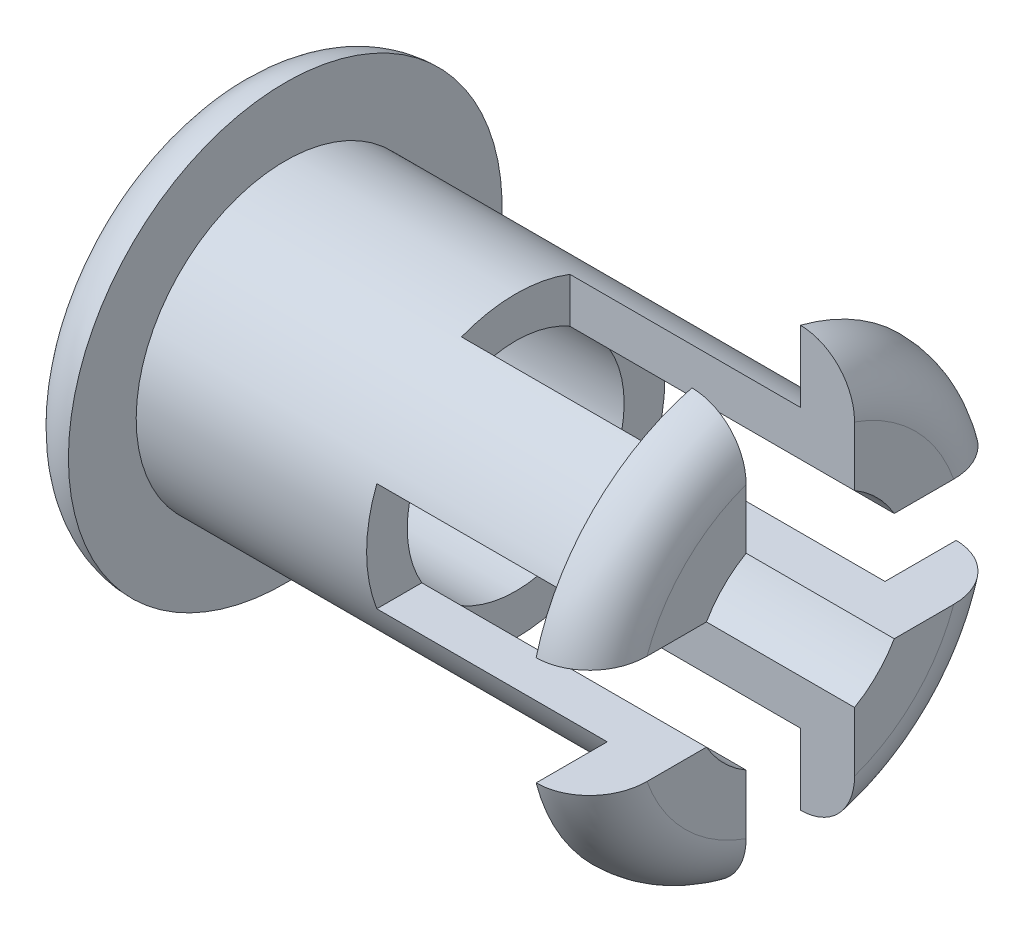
ISO-10303-21;
HEADER;
FILE_DESCRIPTION(('STEP AP214'),'2;1');
FILE_NAME('part.step','',(''),(''),'','','');
FILE_SCHEMA(('AUTOMOTIVE_DESIGN { 1 0 10303 214 1 1 1 1 }'));
ENDSEC;
DATA;
#1=APPLICATION_CONTEXT('core data for automotive mechanical design processes');
#2=APPLICATION_PROTOCOL_DEFINITION('international standard','automotive_design',2000,#1);
#3=PRODUCT_CONTEXT('',#1,'mechanical');
#4=PRODUCT('Part','Part','',(#3));
#5=PRODUCT_RELATED_PRODUCT_CATEGORY('part','',(#4));
#6=PRODUCT_DEFINITION_FORMATION('','',#4);
#7=PRODUCT_DEFINITION_CONTEXT('part definition',#1,'design');
#8=PRODUCT_DEFINITION('design','',#6,#7);
#9=PRODUCT_DEFINITION_SHAPE('','',#8);
#10=(LENGTH_UNIT() NAMED_UNIT(*) SI_UNIT(.MILLI.,.METRE.));
#11=(NAMED_UNIT(*) PLANE_ANGLE_UNIT() SI_UNIT($,.RADIAN.));
#12=(NAMED_UNIT(*) SI_UNIT($,.STERADIAN.) SOLID_ANGLE_UNIT());
#13=UNCERTAINTY_MEASURE_WITH_UNIT(LENGTH_MEASURE(1.E-05),#10,'distance_accuracy_value','');
#14=(GEOMETRIC_REPRESENTATION_CONTEXT(3) GLOBAL_UNCERTAINTY_ASSIGNED_CONTEXT((#13)) GLOBAL_UNIT_ASSIGNED_CONTEXT((#10,
#11,#12)) REPRESENTATION_CONTEXT('',''));
#15=CARTESIAN_POINT('',(0.,0.,0.));
#16=DIRECTION('',(0.,0.,1.));
#17=DIRECTION('',(1.,0.,0.));
#18=AXIS2_PLACEMENT_3D('',#15,#16,#17);
#19=CARTESIAN_POINT('',(16.66875,0.,0.));
#20=DIRECTION('',(1.,0.,0.));
#21=DIRECTION('',(0.,0.,-1.));
#22=AXIS2_PLACEMENT_3D('',#19,#20,#21);
#23=PLANE('',#22);
#24=DIRECTION('',(0.,0.,1.));
#25=VECTOR('',#24,1.);
#26=CARTESIAN_POINT('',(16.66875,3.175,-12.7));
#27=LINE('',#26,#25);
#28=CARTESIAN_POINT('',(16.66875,3.175,-8.98025612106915));
#29=VERTEX_POINT('',#28);
#30=CARTESIAN_POINT('',(16.66875,3.175,-5.49926131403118));
#31=VERTEX_POINT('',#30);
#32=EDGE_CURVE('E319',#29,#31,#27,.T.);
#33=ORIENTED_EDGE('',*,*,#32,.F.);
#34=CARTESIAN_POINT('',(16.66875,0.,0.));
#35=DIRECTION('',(1.,0.,0.));
#36=DIRECTION('',(0.,0.,-1.));
#37=AXIS2_PLACEMENT_3D('',#34,#35,#36);
#38=CIRCLE('',#37,9.525);
#39=CARTESIAN_POINT('',(16.66875,8.98025612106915,-3.175));
#40=VERTEX_POINT('',#39);
#41=EDGE_CURVE('E443',#29,#40,#38,.T.);
#42=ORIENTED_EDGE('',*,*,#41,.T.);
#43=DIRECTION('',(0.,1.,0.));
#44=VECTOR('',#43,1.);
#45=CARTESIAN_POINT('',(16.66875,-12.7,-3.175));
#46=LINE('',#45,#44);
#47=CARTESIAN_POINT('',(16.66875,5.49926131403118,-3.175));
#48=VERTEX_POINT('',#47);
#49=EDGE_CURVE('E207',#48,#40,#46,.T.);
#50=ORIENTED_EDGE('',*,*,#49,.F.);
#51=CARTESIAN_POINT('',(16.66875,0.,0.));
#52=DIRECTION('',(-1.,0.,0.));
#53=DIRECTION('',(0.,0.,1.));
#54=AXIS2_PLACEMENT_3D('',#51,#52,#53);
#55=CIRCLE('',#54,6.35);
#56=EDGE_CURVE('E230',#48,#31,#55,.T.);
#57=ORIENTED_EDGE('',*,*,#56,.T.);
#58=EDGE_LOOP('',(#33,#42,#50,#57));
#59=FACE_BOUND('',#58,.T.);
#60=ADVANCED_FACE('F32',(#59),#23,.T.);
#61=CARTESIAN_POINT('',(13.49375,0.,0.));
#62=DIRECTION('',(1.,0.,0.));
#63=DIRECTION('',(0.,0.,-1.));
#64=AXIS2_PLACEMENT_3D('',#61,#62,#63);
#65=PLANE('',#64);
#66=CARTESIAN_POINT('',(13.49375,0.,0.));
#67=DIRECTION('',(1.,0.,0.));
#68=DIRECTION('',(0.,0.,-1.));
#69=AXIS2_PLACEMENT_3D('',#66,#67,#68);
#70=CIRCLE('',#69,8.73125);
#71=CARTESIAN_POINT('',(13.49375,3.175,-8.13351717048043));
#72=VERTEX_POINT('',#71);
#73=CARTESIAN_POINT('',(13.49375,8.13351717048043,-3.175));
#74=VERTEX_POINT('',#73);
#75=EDGE_CURVE('E349',#72,#74,#70,.T.);
#76=ORIENTED_EDGE('',*,*,#75,.T.);
#77=DIRECTION('',(0.,1.,0.));
#78=VECTOR('',#77,1.);
#79=CARTESIAN_POINT('',(13.49375,0.,-3.175));
#80=LINE('',#79,#78);
#81=CARTESIAN_POINT('',(13.49375,12.2967221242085,-3.175));
#82=VERTEX_POINT('',#81);
#83=EDGE_CURVE('E450',#74,#82,#80,.T.);
#84=ORIENTED_EDGE('',*,*,#83,.T.);
#85=CARTESIAN_POINT('',(13.49375,0.,0.));
#86=DIRECTION('',(1.,0.,0.));
#87=DIRECTION('',(0.,0.,-1.));
#88=AXIS2_PLACEMENT_3D('',#85,#86,#87);
#89=CIRCLE('',#88,12.7);
#90=CARTESIAN_POINT('',(13.49375,3.175,-12.2967221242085));
#91=VERTEX_POINT('',#90);
#92=EDGE_CURVE('E247',#91,#82,#89,.T.);
#93=ORIENTED_EDGE('',*,*,#92,.F.);
#94=DIRECTION('',(0.,0.,1.));
#95=VECTOR('',#94,1.);
#96=CARTESIAN_POINT('',(13.49375,3.175,0.));
#97=LINE('',#96,#95);
#98=EDGE_CURVE('E278',#91,#72,#97,.T.);
#99=ORIENTED_EDGE('',*,*,#98,.T.);
#100=EDGE_LOOP('',(#76,#84,#93,#99));
#101=FACE_BOUND('',#100,.T.);
#102=ADVANCED_FACE('F453',(#101),#65,.F.);
#103=CARTESIAN_POINT('',(16.66875,-8.98025612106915,-3.175));
#104=VERTEX_POINT('',#103);
#105=CARTESIAN_POINT('',(16.66875,-5.49926131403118,-3.175));
#106=VERTEX_POINT('',#105);
#107=EDGE_CURVE('E464',#104,#106,#46,.T.);
#108=ORIENTED_EDGE('',*,*,#107,.F.);
#109=CARTESIAN_POINT('',(16.66875,0.,0.));
#110=DIRECTION('',(1.,0.,0.));
#111=DIRECTION('',(0.,0.,-1.));
#112=AXIS2_PLACEMENT_3D('',#109,#110,#111);
#113=CIRCLE('',#112,9.525);
#114=CARTESIAN_POINT('',(16.66875,-3.175,-8.98025612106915));
#115=VERTEX_POINT('',#114);
#116=EDGE_CURVE('E418',#104,#115,#113,.T.);
#117=ORIENTED_EDGE('',*,*,#116,.T.);
#118=DIRECTION('',(0.,0.,1.));
#119=VECTOR('',#118,1.);
#120=CARTESIAN_POINT('',(16.66875,-3.175,-12.7));
#121=LINE('',#120,#119);
#122=CARTESIAN_POINT('',(16.66875,-3.175,-5.49926131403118));
#123=VERTEX_POINT('',#122);
#124=EDGE_CURVE('E327',#115,#123,#121,.T.);
#125=ORIENTED_EDGE('',*,*,#124,.T.);
#126=EDGE_CURVE('E227',#123,#106,#55,.T.);
#127=ORIENTED_EDGE('',*,*,#126,.T.);
#128=EDGE_LOOP('',(#108,#117,#125,#127));
#129=FACE_BOUND('',#128,.T.);
#130=ADVANCED_FACE('F496',(#129),#23,.T.);
#131=CARTESIAN_POINT('',(13.49375,-12.2967221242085,-3.175));
#132=VERTEX_POINT('',#131);
#133=CARTESIAN_POINT('',(13.49375,-3.175,-12.2967221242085));
#134=VERTEX_POINT('',#133);
#135=EDGE_CURVE('E239',#132,#134,#89,.T.);
#136=ORIENTED_EDGE('',*,*,#135,.F.);
#137=DIRECTION('',(0.,1.,0.));
#138=VECTOR('',#137,1.);
#139=CARTESIAN_POINT('',(13.49375,0.,-3.175));
#140=LINE('',#139,#138);
#141=CARTESIAN_POINT('',(13.49375,-8.13351717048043,-3.175));
#142=VERTEX_POINT('',#141);
#143=EDGE_CURVE('E479',#132,#142,#140,.T.);
#144=ORIENTED_EDGE('',*,*,#143,.T.);
#145=CARTESIAN_POINT('',(13.49375,-3.175,-8.13351717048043));
#146=VERTEX_POINT('',#145);
#147=EDGE_CURVE('E347',#142,#146,#70,.T.);
#148=ORIENTED_EDGE('',*,*,#147,.T.);
#149=DIRECTION('',(0.,0.,-1.));
#150=VECTOR('',#149,1.);
#151=CARTESIAN_POINT('',(13.49375,-3.175,0.));
#152=LINE('',#151,#150);
#153=EDGE_CURVE('E313',#146,#134,#152,.T.);
#154=ORIENTED_EDGE('',*,*,#153,.T.);
#155=EDGE_LOOP('',(#136,#144,#148,#154));
#156=FACE_BOUND('',#155,.T.);
#157=ADVANCED_FACE('F504',(#156),#65,.F.);
#158=DIRECTION('',(0.,1.,0.));
#159=VECTOR('',#158,1.);
#160=CARTESIAN_POINT('',(16.66875,-12.7,3.175));
#161=LINE('',#160,#159);
#162=CARTESIAN_POINT('',(16.66875,5.49926131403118,3.175));
#163=VERTEX_POINT('',#162);
#164=CARTESIAN_POINT('',(16.66875,8.98025612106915,3.175));
#165=VERTEX_POINT('',#164);
#166=EDGE_CURVE('E208',#163,#165,#161,.T.);
#167=ORIENTED_EDGE('',*,*,#166,.T.);
#168=CARTESIAN_POINT('',(16.66875,0.,0.));
#169=DIRECTION('',(1.,0.,0.));
#170=DIRECTION('',(0.,0.,-1.));
#171=AXIS2_PLACEMENT_3D('',#168,#169,#170);
#172=CIRCLE('',#171,9.525);
#173=CARTESIAN_POINT('',(16.66875,3.175,8.98025612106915));
#174=VERTEX_POINT('',#173);
#175=EDGE_CURVE('E487',#165,#174,#172,.T.);
#176=ORIENTED_EDGE('',*,*,#175,.T.);
#177=CARTESIAN_POINT('',(16.66875,3.175,5.49926131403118));
#178=VERTEX_POINT('',#177);
#179=EDGE_CURVE('E324',#178,#174,#27,.T.);
#180=ORIENTED_EDGE('',*,*,#179,.F.);
#181=EDGE_CURVE('E231',#178,#163,#55,.T.);
#182=ORIENTED_EDGE('',*,*,#181,.T.);
#183=EDGE_LOOP('',(#167,#176,#180,#182));
#184=FACE_BOUND('',#183,.T.);
#185=ADVANCED_FACE('F486',(#184),#23,.T.);
#186=CARTESIAN_POINT('',(13.49375,12.2967221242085,3.175));
#187=VERTEX_POINT('',#186);
#188=CARTESIAN_POINT('',(13.49375,3.175,12.2967221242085));
#189=VERTEX_POINT('',#188);
#190=EDGE_CURVE('E248',#187,#189,#89,.T.);
#191=ORIENTED_EDGE('',*,*,#190,.F.);
#192=DIRECTION('',(0.,-1.,0.));
#193=VECTOR('',#192,1.);
#194=CARTESIAN_POINT('',(13.49375,0.,3.175));
#195=LINE('',#194,#193);
#196=CARTESIAN_POINT('',(13.49375,8.13351717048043,3.175));
#197=VERTEX_POINT('',#196);
#198=EDGE_CURVE('E268',#187,#197,#195,.T.);
#199=ORIENTED_EDGE('',*,*,#198,.T.);
#200=CARTESIAN_POINT('',(13.49375,3.175,8.13351717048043));
#201=VERTEX_POINT('',#200);
#202=EDGE_CURVE('E272',#197,#201,#70,.T.);
#203=ORIENTED_EDGE('',*,*,#202,.T.);
#204=EDGE_CURVE('E271',#201,#189,#97,.T.);
#205=ORIENTED_EDGE('',*,*,#204,.T.);
#206=EDGE_LOOP('',(#191,#199,#203,#205));
#207=FACE_BOUND('',#206,.T.);
#208=ADVANCED_FACE('F267',(#207),#65,.F.);
#209=CARTESIAN_POINT('',(13.49375,0.,0.));
#210=DIRECTION('',(-1.,0.,0.));
#211=DIRECTION('',(0.,0.,1.));
#212=AXIS2_PLACEMENT_3D('',#209,#210,#211);
#213=CYLINDRICAL_SURFACE('',#212,8.73125);
#214=CARTESIAN_POINT('',(0.,0.,0.));
#215=DIRECTION('',(-1.,0.,0.));
#216=DIRECTION('',(0.,0.,1.));
#217=AXIS2_PLACEMENT_3D('',#214,#215,#216);
#218=CIRCLE('',#217,8.73125);
#219=CARTESIAN_POINT('',(0.,8.13351717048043,3.175));
#220=VERTEX_POINT('',#219);
#221=CARTESIAN_POINT('',(0.,8.13351717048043,-3.175));
#222=VERTEX_POINT('',#221);
#223=EDGE_CURVE('E332',#220,#222,#218,.T.);
#224=ORIENTED_EDGE('',*,*,#223,.T.);
#225=DIRECTION('',(-1.,0.,0.));
#226=VECTOR('',#225,1.);
#227=CARTESIAN_POINT('',(13.49375,8.13351717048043,-3.175));
#228=LINE('',#227,#226);
#229=EDGE_CURVE('E454',#222,#74,#228,.F.);
#230=ORIENTED_EDGE('',*,*,#229,.T.);
#231=ORIENTED_EDGE('',*,*,#75,.F.);
#232=DIRECTION('',(-1.,0.,0.));
#233=VECTOR('',#232,1.);
#234=CARTESIAN_POINT('',(13.49375,3.175,-8.13351717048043));
#235=LINE('',#234,#233);
#236=CARTESIAN_POINT('',(0.,3.175,-8.13351717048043));
#237=VERTEX_POINT('',#236);
#238=EDGE_CURVE('E284',#72,#237,#235,.T.);
#239=ORIENTED_EDGE('',*,*,#238,.T.);
#240=CARTESIAN_POINT('',(0.,0.,0.));
#241=DIRECTION('',(-1.,0.,0.));
#242=DIRECTION('',(0.,0.,1.));
#243=AXIS2_PLACEMENT_3D('',#240,#241,#242);
#244=CIRCLE('',#243,8.73125);
#245=CARTESIAN_POINT('',(0.,-3.175,-8.13351717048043));
#246=VERTEX_POINT('',#245);
#247=EDGE_CURVE('E234',#237,#246,#244,.T.);
#248=ORIENTED_EDGE('',*,*,#247,.T.);
#249=DIRECTION('',(-1.,0.,0.));
#250=VECTOR('',#249,1.);
#251=CARTESIAN_POINT('',(13.49375,-3.175,-8.13351717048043));
#252=LINE('',#251,#250);
#253=EDGE_CURVE('E300',#246,#146,#252,.F.);
#254=ORIENTED_EDGE('',*,*,#253,.T.);
#255=ORIENTED_EDGE('',*,*,#147,.F.);
#256=DIRECTION('',(-1.,0.,0.));
#257=VECTOR('',#256,1.);
#258=CARTESIAN_POINT('',(13.49375,-8.13351717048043,-3.175));
#259=LINE('',#258,#257);
#260=CARTESIAN_POINT('',(0.,-8.13351717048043,-3.175));
#261=VERTEX_POINT('',#260);
#262=EDGE_CURVE('E455',#142,#261,#259,.T.);
#263=ORIENTED_EDGE('',*,*,#262,.T.);
#264=CARTESIAN_POINT('',(0.,-8.13351717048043,3.175));
#265=VERTEX_POINT('',#264);
#266=EDGE_CURVE('E322',#261,#265,#218,.T.);
#267=ORIENTED_EDGE('',*,*,#266,.T.);
#268=DIRECTION('',(-1.,0.,0.));
#269=VECTOR('',#268,1.);
#270=CARTESIAN_POINT('',(13.49375,-8.13351717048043,3.175));
#271=LINE('',#270,#269);
#272=CARTESIAN_POINT('',(13.49375,-8.13351717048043,3.175));
#273=VERTEX_POINT('',#272);
#274=EDGE_CURVE('E346',#265,#273,#271,.F.);
#275=ORIENTED_EDGE('',*,*,#274,.T.);
#276=CARTESIAN_POINT('',(13.49375,-3.175,8.13351717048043));
#277=VERTEX_POINT('',#276);
#278=EDGE_CURVE('E341',#277,#273,#70,.T.);
#279=ORIENTED_EDGE('',*,*,#278,.F.);
#280=DIRECTION('',(-1.,0.,0.));
#281=VECTOR('',#280,1.);
#282=CARTESIAN_POINT('',(13.49375,-3.175,8.13351717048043));
#283=LINE('',#282,#281);
#284=CARTESIAN_POINT('',(0.,-3.175,8.13351717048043));
#285=VERTEX_POINT('',#284);
#286=EDGE_CURVE('E276',#277,#285,#283,.T.);
#287=ORIENTED_EDGE('',*,*,#286,.T.);
#288=CARTESIAN_POINT('',(0.,3.175,8.13351717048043));
#289=VERTEX_POINT('',#288);
#290=EDGE_CURVE('E290',#285,#289,#244,.T.);
#291=ORIENTED_EDGE('',*,*,#290,.T.);
#292=DIRECTION('',(-1.,0.,0.));
#293=VECTOR('',#292,1.);
#294=CARTESIAN_POINT('',(13.49375,3.175,8.13351717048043));
#295=LINE('',#294,#293);
#296=EDGE_CURVE('E275',#289,#201,#295,.F.);
#297=ORIENTED_EDGE('',*,*,#296,.T.);
#298=ORIENTED_EDGE('',*,*,#202,.F.);
#299=DIRECTION('',(-1.,0.,0.));
#300=VECTOR('',#299,1.);
#301=CARTESIAN_POINT('',(13.49375,8.13351717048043,3.175));
#302=LINE('',#301,#300);
#303=EDGE_CURVE('E476',#197,#220,#302,.T.);
#304=ORIENTED_EDGE('',*,*,#303,.T.);
#305=EDGE_LOOP('',(#224,#230,#231,#239,#248,#254,#255,#263,#267,#275,#279,#287,#291,#297,#298,#304));
#306=FACE_BOUND('',#305,.T.);
#307=CARTESIAN_POINT('',(-13.49375,0.,0.));
#308=DIRECTION('',(1.,0.,0.));
#309=DIRECTION('',(0.,0.,-1.));
#310=AXIS2_PLACEMENT_3D('',#307,#308,#309);
#311=CIRCLE('',#310,8.73125);
#312=CARTESIAN_POINT('',(-13.49375,0.,-8.73125));
#313=VERTEX_POINT('',#312);
#314=EDGE_CURVE('E350',#313,#313,#311,.T.);
#315=ORIENTED_EDGE('',*,*,#314,.T.);
#316=EDGE_LOOP('',(#315));
#317=FACE_BOUND('',#316,.T.);
#318=ADVANCED_FACE('F297',(#306,#317),#213,.T.);
#319=CARTESIAN_POINT('',(-16.66875,0.,0.));
#320=DIRECTION('',(-1.,0.,0.));
#321=DIRECTION('',(0.,0.,1.));
#322=AXIS2_PLACEMENT_3D('',#319,#320,#321);
#323=PLANE('',#322);
#324=CARTESIAN_POINT('',(-16.66875,0.,0.));
#325=DIRECTION('',(-1.,0.,0.));
#326=DIRECTION('',(0.,0.,1.));
#327=AXIS2_PLACEMENT_3D('',#324,#325,#326);
#328=CIRCLE('',#327,9.525);
#329=CARTESIAN_POINT('',(-16.66875,0.,9.525));
#330=VERTEX_POINT('',#329);
#331=EDGE_CURVE('E377',#330,#330,#328,.T.);
#332=ORIENTED_EDGE('',*,*,#331,.T.);
#333=EDGE_LOOP('',(#332));
#334=FACE_BOUND('',#333,.T.);
#335=CARTESIAN_POINT('',(-16.66875,0.,0.));
#336=DIRECTION('',(-1.,0.,0.));
#337=DIRECTION('',(0.,0.,1.));
#338=AXIS2_PLACEMENT_3D('',#335,#336,#337);
#339=CIRCLE('',#338,6.35);
#340=CARTESIAN_POINT('',(-16.66875,0.,6.35));
#341=VERTEX_POINT('',#340);
#342=EDGE_CURVE('E228',#341,#341,#339,.T.);
#343=ORIENTED_EDGE('',*,*,#342,.F.);
#344=EDGE_LOOP('',(#343));
#345=FACE_BOUND('',#344,.T.);
#346=ADVANCED_FACE('F526',(#334,#345),#323,.T.);
#347=CARTESIAN_POINT('',(-13.49375,0.,0.));
#348=DIRECTION('',(-1.,0.,0.));
#349=DIRECTION('',(0.,0.,1.));
#350=AXIS2_PLACEMENT_3D('',#347,#348,#349);
#351=PLANE('',#350);
#352=ORIENTED_EDGE('',*,*,#314,.F.);
#353=EDGE_LOOP('',(#352));
#354=FACE_BOUND('',#353,.T.);
#355=CARTESIAN_POINT('',(-13.49375,0.,0.));
#356=DIRECTION('',(-1.,0.,0.));
#357=DIRECTION('',(0.,0.,1.));
#358=AXIS2_PLACEMENT_3D('',#355,#356,#357);
#359=CIRCLE('',#358,12.7);
#360=CARTESIAN_POINT('',(-13.49375,0.,12.7));
#361=VERTEX_POINT('',#360);
#362=EDGE_CURVE('E254',#361,#361,#359,.T.);
#363=ORIENTED_EDGE('',*,*,#362,.F.);
#364=EDGE_LOOP('',(#363));
#365=FACE_BOUND('',#364,.T.);
#366=ADVANCED_FACE('F521',(#354,#365),#351,.F.);
#367=CARTESIAN_POINT('',(16.66875,-3.175,5.49926131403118));
#368=VERTEX_POINT('',#367);
#369=CARTESIAN_POINT('',(16.66875,-3.175,8.98025612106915));
#370=VERTEX_POINT('',#369);
#371=EDGE_CURVE('E328',#368,#370,#121,.T.);
#372=ORIENTED_EDGE('',*,*,#371,.T.);
#373=CARTESIAN_POINT('',(16.66875,0.,0.));
#374=DIRECTION('',(1.,0.,0.));
#375=DIRECTION('',(0.,0.,-1.));
#376=AXIS2_PLACEMENT_3D('',#373,#374,#375);
#377=CIRCLE('',#376,9.525);
#378=CARTESIAN_POINT('',(16.66875,-8.98025612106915,3.175));
#379=VERTEX_POINT('',#378);
#380=EDGE_CURVE('E205',#370,#379,#377,.T.);
#381=ORIENTED_EDGE('',*,*,#380,.T.);
#382=CARTESIAN_POINT('',(16.66875,-5.49926131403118,3.175));
#383=VERTEX_POINT('',#382);
#384=EDGE_CURVE('E197',#379,#383,#161,.T.);
#385=ORIENTED_EDGE('',*,*,#384,.T.);
#386=EDGE_CURVE('E202',#383,#368,#55,.T.);
#387=ORIENTED_EDGE('',*,*,#386,.T.);
#388=EDGE_LOOP('',(#372,#381,#385,#387));
#389=FACE_BOUND('',#388,.T.);
#390=ADVANCED_FACE('F200',(#389),#23,.T.);
#391=ORIENTED_EDGE('',*,*,#278,.T.);
#392=DIRECTION('',(0.,-1.,0.));
#393=VECTOR('',#392,1.);
#394=CARTESIAN_POINT('',(13.49375,0.,3.175));
#395=LINE('',#394,#393);
#396=CARTESIAN_POINT('',(13.49375,-12.2967221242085,3.175));
#397=VERTEX_POINT('',#396);
#398=EDGE_CURVE('E467',#273,#397,#395,.T.);
#399=ORIENTED_EDGE('',*,*,#398,.T.);
#400=CARTESIAN_POINT('',(13.49375,-3.175,12.2967221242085));
#401=VERTEX_POINT('',#400);
#402=EDGE_CURVE('E245',#401,#397,#89,.T.);
#403=ORIENTED_EDGE('',*,*,#402,.F.);
#404=EDGE_CURVE('E281',#401,#277,#152,.T.);
#405=ORIENTED_EDGE('',*,*,#404,.T.);
#406=EDGE_LOOP('',(#391,#399,#403,#405));
#407=FACE_BOUND('',#406,.T.);
#408=ADVANCED_FACE('F339',(#407),#65,.F.);
#409=CARTESIAN_POINT('',(16.66875,0.,0.));
#410=DIRECTION('',(-1.,0.,0.));
#411=DIRECTION('',(0.,0.,1.));
#412=AXIS2_PLACEMENT_3D('',#409,#410,#411);
#413=CYLINDRICAL_SURFACE('',#412,6.35);
#414=ORIENTED_EDGE('',*,*,#56,.F.);
#415=DIRECTION('',(-1.,0.,0.));
#416=VECTOR('',#415,1.);
#417=CARTESIAN_POINT('',(16.66875,5.49926131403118,-3.175));
#418=LINE('',#417,#416);
#419=CARTESIAN_POINT('',(0.,5.49926131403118,-3.175));
#420=VERTEX_POINT('',#419);
#421=EDGE_CURVE('E374',#48,#420,#418,.T.);
#422=ORIENTED_EDGE('',*,*,#421,.T.);
#423=CARTESIAN_POINT('',(0.,0.,0.));
#424=DIRECTION('',(-1.,0.,0.));
#425=DIRECTION('',(0.,0.,1.));
#426=AXIS2_PLACEMENT_3D('',#423,#424,#425);
#427=CIRCLE('',#426,6.35);
#428=CARTESIAN_POINT('',(0.,5.49926131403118,3.175));
#429=VERTEX_POINT('',#428);
#430=EDGE_CURVE('E368',#420,#429,#427,.F.);
#431=ORIENTED_EDGE('',*,*,#430,.T.);
#432=DIRECTION('',(-1.,0.,0.));
#433=VECTOR('',#432,1.);
#434=CARTESIAN_POINT('',(16.66875,5.49926131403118,3.175));
#435=LINE('',#434,#433);
#436=EDGE_CURVE('E371',#429,#163,#435,.F.);
#437=ORIENTED_EDGE('',*,*,#436,.T.);
#438=ORIENTED_EDGE('',*,*,#181,.F.);
#439=DIRECTION('',(-1.,0.,0.));
#440=VECTOR('',#439,1.);
#441=CARTESIAN_POINT('',(16.66875,3.175,5.49926131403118));
#442=LINE('',#441,#440);
#443=CARTESIAN_POINT('',(0.,3.175,5.49926131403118));
#444=VERTEX_POINT('',#443);
#445=EDGE_CURVE('E219',#178,#444,#442,.T.);
#446=ORIENTED_EDGE('',*,*,#445,.T.);
#447=CARTESIAN_POINT('',(0.,0.,0.));
#448=DIRECTION('',(-1.,0.,0.));
#449=DIRECTION('',(0.,0.,1.));
#450=AXIS2_PLACEMENT_3D('',#447,#448,#449);
#451=CIRCLE('',#450,6.35);
#452=CARTESIAN_POINT('',(0.,-3.175,5.49926131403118));
#453=VERTEX_POINT('',#452);
#454=EDGE_CURVE('E360',#444,#453,#451,.F.);
#455=ORIENTED_EDGE('',*,*,#454,.T.);
#456=DIRECTION('',(-1.,0.,0.));
#457=VECTOR('',#456,1.);
#458=CARTESIAN_POINT('',(16.66875,-3.175,5.49926131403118));
#459=LINE('',#458,#457);
#460=EDGE_CURVE('E226',#453,#368,#459,.F.);
#461=ORIENTED_EDGE('',*,*,#460,.T.);
#462=ORIENTED_EDGE('',*,*,#386,.F.);
#463=DIRECTION('',(-1.,0.,0.));
#464=VECTOR('',#463,1.);
#465=CARTESIAN_POINT('',(16.66875,-5.49926131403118,3.175));
#466=LINE('',#465,#464);
#467=CARTESIAN_POINT('',(0.,-5.49926131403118,3.175));
#468=VERTEX_POINT('',#467);
#469=EDGE_CURVE('E211',#383,#468,#466,.T.);
#470=ORIENTED_EDGE('',*,*,#469,.T.);
#471=CARTESIAN_POINT('',(0.,-5.49926131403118,-3.175));
#472=VERTEX_POINT('',#471);
#473=EDGE_CURVE('E218',#468,#472,#427,.F.);
#474=ORIENTED_EDGE('',*,*,#473,.T.);
#475=DIRECTION('',(-1.,0.,0.));
#476=VECTOR('',#475,1.);
#477=CARTESIAN_POINT('',(16.66875,-5.49926131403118,-3.175));
#478=LINE('',#477,#476);
#479=EDGE_CURVE('E367',#472,#106,#478,.F.);
#480=ORIENTED_EDGE('',*,*,#479,.T.);
#481=ORIENTED_EDGE('',*,*,#126,.F.);
#482=DIRECTION('',(-1.,0.,0.));
#483=VECTOR('',#482,1.);
#484=CARTESIAN_POINT('',(16.66875,-3.175,-5.49926131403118));
#485=LINE('',#484,#483);
#486=CARTESIAN_POINT('',(0.,-3.175,-5.49926131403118));
#487=VERTEX_POINT('',#486);
#488=EDGE_CURVE('E352',#123,#487,#485,.T.);
#489=ORIENTED_EDGE('',*,*,#488,.T.);
#490=CARTESIAN_POINT('',(0.,3.175,-5.49926131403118));
#491=VERTEX_POINT('',#490);
#492=EDGE_CURVE('E355',#487,#491,#451,.F.);
#493=ORIENTED_EDGE('',*,*,#492,.T.);
#494=DIRECTION('',(-1.,0.,0.));
#495=VECTOR('',#494,1.);
#496=CARTESIAN_POINT('',(16.66875,3.175,-5.49926131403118));
#497=LINE('',#496,#495);
#498=EDGE_CURVE('E312',#491,#31,#497,.F.);
#499=ORIENTED_EDGE('',*,*,#498,.T.);
#500=EDGE_LOOP('',(#414,#422,#431,#437,#438,#446,#455,#461,#462,#470,#474,#480,#481,#489,#493,#499));
#501=FACE_BOUND('',#500,.T.);
#502=ORIENTED_EDGE('',*,*,#342,.T.);
#503=EDGE_LOOP('',(#502));
#504=FACE_BOUND('',#503,.T.);
#505=ADVANCED_FACE('F223',(#501,#504),#413,.F.);
#506=CARTESIAN_POINT('',(0.,-3.175,-12.7));
#507=DIRECTION('',(0.,-1.,0.));
#508=DIRECTION('',(0.,0.,-1.));
#509=AXIS2_PLACEMENT_3D('',#506,#507,#508);
#510=PLANE('',#509);
#511=ORIENTED_EDGE('',*,*,#124,.F.);
#512=CARTESIAN_POINT('',(16.66875,-3.175,-8.98025612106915));
#513=CARTESIAN_POINT('',(16.6687574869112,-3.175,-9.07722284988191));
#514=CARTESIAN_POINT('',(16.6648012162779,-3.175,-9.17419353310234));
#515=CARTESIAN_POINT('',(16.6489305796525,-3.175,-9.36749956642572));
#516=CARTESIAN_POINT('',(16.637014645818,-3.175,-9.46383478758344));
#517=CARTESIAN_POINT('',(16.6051736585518,-3.175,-9.65531070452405));
#518=CARTESIAN_POINT('',(16.585238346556,-3.175,-9.75044970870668));
#519=CARTESIAN_POINT('',(16.5374214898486,-3.175,-9.9386747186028));
#520=CARTESIAN_POINT('',(16.5095405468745,-3.175,-10.031760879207));
#521=CARTESIAN_POINT('',(16.4139707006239,-3.175,-10.3072312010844));
#522=CARTESIAN_POINT('',(16.3343815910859,-3.175,-10.4856646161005));
#523=CARTESIAN_POINT('',(16.1453016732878,-3.175,-10.8256425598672));
#524=CARTESIAN_POINT('',(16.0358384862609,-3.175,-10.9872024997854));
#525=CARTESIAN_POINT('',(15.7944531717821,-3.175,-11.2824650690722));
#526=CARTESIAN_POINT('',(15.6635422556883,-3.175,-11.4169928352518));
#527=CARTESIAN_POINT('',(15.3800908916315,-3.175,-11.6610553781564));
#528=CARTESIAN_POINT('',(15.2275467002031,-3.175,-11.7705858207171));
#529=CARTESIAN_POINT('',(14.9119649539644,-3.175,-11.9568805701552));
#530=CARTESIAN_POINT('',(14.7496040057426,-3.175,-12.0347937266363));
#531=CARTESIAN_POINT('',(14.4139400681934,-3.175,-12.1613492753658));
#532=CARTESIAN_POINT('',(14.2406496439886,-3.175,-12.210024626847));
#533=CARTESIAN_POINT('',(13.9704779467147,-3.175,-12.2610569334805));
#534=CARTESIAN_POINT('',(13.8755521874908,-3.175,-12.2744273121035));
#535=CARTESIAN_POINT('',(13.6850166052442,-3.175,-12.2922544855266));
#536=CARTESIAN_POINT('',(13.5894080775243,-3.175,-12.2967251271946));
#537=CARTESIAN_POINT('',(13.49375,-3.175,-12.2967221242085));
#538=B_SPLINE_CURVE_WITH_KNOTS('',3,(#512,#513,#514,#515,#516,#517,#518,#519,#520,#521,#522,
#523,#524,#525,#526,#527,#528,#529,#530,#531,#532,#533,#534,#535,#536,#537),.UNSPECIFIED.,.F.,
.F.,(4,2,2,2,2,2,2,2,2,2,2,2,4),(0.,0.290823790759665,0.581704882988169,0.872959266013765,
1.16419159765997,1.74714425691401,2.32955974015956,2.88984898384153,3.45023529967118,
3.9878912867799,4.52494004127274,4.81215947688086,5.09893168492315),.UNSPECIFIED.);
#539=EDGE_CURVE('E431',#115,#134,#538,.T.);
#540=ORIENTED_EDGE('',*,*,#539,.T.);
#541=ORIENTED_EDGE('',*,*,#153,.F.);
#542=ORIENTED_EDGE('',*,*,#253,.F.);
#543=DIRECTION('',(0.,0.,1.));
#544=VECTOR('',#543,1.);
#545=CARTESIAN_POINT('',(0.,-3.175,-12.7));
#546=LINE('',#545,#544);
#547=EDGE_CURVE('E309',#246,#487,#546,.T.);
#548=ORIENTED_EDGE('',*,*,#547,.T.);
#549=ORIENTED_EDGE('',*,*,#488,.F.);
#550=EDGE_LOOP('',(#511,#540,#541,#542,#548,#549));
#551=FACE_BOUND('',#550,.T.);
#552=ADVANCED_FACE('F501',(#551),#510,.F.);
#553=CARTESIAN_POINT('',(0.,3.175,-12.7));
#554=DIRECTION('',(0.,1.,0.));
#555=DIRECTION('',(0.,0.,1.));
#556=AXIS2_PLACEMENT_3D('',#553,#554,#555);
#557=PLANE('',#556);
#558=ORIENTED_EDGE('',*,*,#98,.F.);
#559=CARTESIAN_POINT('',(13.49375,3.175,-12.2967221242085));
#560=CARTESIAN_POINT('',(13.5808354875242,3.175,-12.2967319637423));
#561=CARTESIAN_POINT('',(13.6679162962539,3.175,-12.2930217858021));
#562=CARTESIAN_POINT('',(13.8414423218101,3.175,-12.2782372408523));
#563=CARTESIAN_POINT('',(13.9278875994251,3.175,-12.2671635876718));
#564=CARTESIAN_POINT('',(14.0994050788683,3.175,-12.2377499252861));
#565=CARTESIAN_POINT('',(14.1844791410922,3.175,-12.2194208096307));
#566=CARTESIAN_POINT('',(14.352756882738,3.175,-12.1756640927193));
#567=CARTESIAN_POINT('',(14.4359605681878,3.175,-12.150236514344));
#568=CARTESIAN_POINT('',(14.6819276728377,3.175,-12.0635625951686));
#569=CARTESIAN_POINT('',(14.8411599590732,3.175,-11.9919055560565));
#570=CARTESIAN_POINT('',(15.1454201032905,3.175,-11.8231988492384));
#571=CARTESIAN_POINT('',(15.2904474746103,3.175,-11.7261483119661));
#572=CARTESIAN_POINT('',(15.564192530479,3.175,-11.508387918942));
#573=CARTESIAN_POINT('',(15.6927082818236,3.175,-11.3874240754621));
#574=CARTESIAN_POINT('',(15.9283164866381,3.175,-11.1261957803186));
#575=CARTESIAN_POINT('',(16.0354060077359,3.175,-10.9859286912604));
#576=CARTESIAN_POINT('',(16.2286734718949,3.175,-10.6856550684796));
#577=CARTESIAN_POINT('',(16.3141240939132,3.175,-10.5251811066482));
#578=CARTESIAN_POINT('',(16.458112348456,3.175,-10.1925507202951));
#579=CARTESIAN_POINT('',(16.5166439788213,3.175,-10.0203917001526));
#580=CARTESIAN_POINT('',(16.5971708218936,3.175,-9.70353609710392));
#581=CARTESIAN_POINT('',(16.6240744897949,3.175,-9.56005840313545));
#582=CARTESIAN_POINT('',(16.6598656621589,3.175,-9.27113713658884));
#583=CARTESIAN_POINT('',(16.6687863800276,3.175,-9.12569768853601));
#584=CARTESIAN_POINT('',(16.66875,3.175,-8.98025612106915));
#585=B_SPLINE_CURVE_WITH_KNOTS('',3,(#559,#560,#561,#562,#563,#564,#565,#566,#567,#568,#569,
#570,#571,#572,#573,#574,#575,#576,#577,#578,#579,#580,#581,#582,#583,#584),.UNSPECIFIED.,.F.,
.F.,(4,2,2,2,2,2,2,2,2,2,2,2,4),(0.,0.261169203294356,0.522313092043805,0.783066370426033,
1.04381880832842,1.56498453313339,2.08616810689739,2.61321750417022,3.14033898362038,
3.68334335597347,4.22646874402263,4.66330643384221,5.09933656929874),.UNSPECIFIED.);
#586=EDGE_CURVE('E11',#91,#29,#585,.T.);
#587=ORIENTED_EDGE('',*,*,#586,.T.);
#588=ORIENTED_EDGE('',*,*,#32,.T.);
#589=ORIENTED_EDGE('',*,*,#498,.F.);
#590=DIRECTION('',(0.,0.,1.));
#591=VECTOR('',#590,1.);
#592=CARTESIAN_POINT('',(0.,3.175,-12.7));
#593=LINE('',#592,#591);
#594=EDGE_CURVE('E307',#237,#491,#593,.T.);
#595=ORIENTED_EDGE('',*,*,#594,.F.);
#596=ORIENTED_EDGE('',*,*,#238,.F.);
#597=EDGE_LOOP('',(#558,#587,#588,#589,#595,#596));
#598=FACE_BOUND('',#597,.T.);
#599=ADVANCED_FACE('F310',(#598),#557,.F.);
#600=CARTESIAN_POINT('',(0.,3.175,-12.7));
#601=DIRECTION('',(-1.,0.,0.));
#602=DIRECTION('',(0.,0.,1.));
#603=AXIS2_PLACEMENT_3D('',#600,#601,#602);
#604=PLANE('',#603);
#605=ORIENTED_EDGE('',*,*,#594,.T.);
#606=ORIENTED_EDGE('',*,*,#492,.F.);
#607=ORIENTED_EDGE('',*,*,#547,.F.);
#608=ORIENTED_EDGE('',*,*,#247,.F.);
#609=EDGE_LOOP('',(#605,#606,#607,#608));
#610=FACE_BOUND('',#609,.T.);
#611=ADVANCED_FACE('F305',(#610),#604,.F.);
#612=EDGE_CURVE('E330',#453,#285,#546,.T.);
#613=ORIENTED_EDGE('',*,*,#612,.F.);
#614=ORIENTED_EDGE('',*,*,#454,.F.);
#615=EDGE_CURVE('E314',#444,#289,#593,.T.);
#616=ORIENTED_EDGE('',*,*,#615,.T.);
#617=ORIENTED_EDGE('',*,*,#290,.F.);
#618=EDGE_LOOP('',(#613,#614,#616,#617));
#619=FACE_BOUND('',#618,.T.);
#620=ADVANCED_FACE('F558',(#619),#604,.F.);
#621=ORIENTED_EDGE('',*,*,#179,.T.);
#622=CARTESIAN_POINT('',(16.66875,3.175,8.98025612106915));
#623=CARTESIAN_POINT('',(16.6687574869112,3.175,9.07722284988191));
#624=CARTESIAN_POINT('',(16.6648012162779,3.175,9.17419353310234));
#625=CARTESIAN_POINT('',(16.6489305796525,3.175,9.36749956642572));
#626=CARTESIAN_POINT('',(16.637014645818,3.175,9.46383478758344));
#627=CARTESIAN_POINT('',(16.6051736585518,3.175,9.65531070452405));
#628=CARTESIAN_POINT('',(16.585238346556,3.175,9.75044970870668));
#629=CARTESIAN_POINT('',(16.5374214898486,3.175,9.9386747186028));
#630=CARTESIAN_POINT('',(16.5095405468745,3.175,10.031760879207));
#631=CARTESIAN_POINT('',(16.4139707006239,3.175,10.3072312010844));
#632=CARTESIAN_POINT('',(16.3343815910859,3.175,10.4856646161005));
#633=CARTESIAN_POINT('',(16.1453016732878,3.175,10.8256425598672));
#634=CARTESIAN_POINT('',(16.0358384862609,3.175,10.9872024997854));
#635=CARTESIAN_POINT('',(15.7944531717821,3.175,11.2824650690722));
#636=CARTESIAN_POINT('',(15.6635422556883,3.175,11.4169928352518));
#637=CARTESIAN_POINT('',(15.3800908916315,3.175,11.6610553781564));
#638=CARTESIAN_POINT('',(15.2275467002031,3.175,11.7705858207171));
#639=CARTESIAN_POINT('',(14.9119649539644,3.175,11.9568805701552));
#640=CARTESIAN_POINT('',(14.7496040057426,3.175,12.0347937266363));
#641=CARTESIAN_POINT('',(14.4139400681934,3.175,12.1613492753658));
#642=CARTESIAN_POINT('',(14.2406496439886,3.175,12.210024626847));
#643=CARTESIAN_POINT('',(13.9704779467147,3.175,12.2610569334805));
#644=CARTESIAN_POINT('',(13.8755521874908,3.175,12.2744273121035));
#645=CARTESIAN_POINT('',(13.6850166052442,3.175,12.2922544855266));
#646=CARTESIAN_POINT('',(13.5894080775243,3.175,12.2967251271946));
#647=CARTESIAN_POINT('',(13.49375,3.175,12.2967221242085));
#648=B_SPLINE_CURVE_WITH_KNOTS('',3,(#622,#623,#624,#625,#626,#627,#628,#629,#630,#631,#632,
#633,#634,#635,#636,#637,#638,#639,#640,#641,#642,#643,#644,#645,#646,#647),.UNSPECIFIED.,.F.,
.F.,(4,2,2,2,2,2,2,2,2,2,2,2,4),(0.,0.290823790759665,0.581704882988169,0.872959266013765,
1.16419159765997,1.74714425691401,2.32955974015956,2.88984898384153,3.45023529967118,
3.9878912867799,4.52494004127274,4.81215947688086,5.09893168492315),.UNSPECIFIED.);
#649=EDGE_CURVE('E261',#174,#189,#648,.T.);
#650=ORIENTED_EDGE('',*,*,#649,.T.);
#651=ORIENTED_EDGE('',*,*,#204,.F.);
#652=ORIENTED_EDGE('',*,*,#296,.F.);
#653=ORIENTED_EDGE('',*,*,#615,.F.);
#654=ORIENTED_EDGE('',*,*,#445,.F.);
#655=EDGE_LOOP('',(#621,#650,#651,#652,#653,#654));
#656=FACE_BOUND('',#655,.T.);
#657=ADVANCED_FACE('F485',(#656),#557,.F.);
#658=ORIENTED_EDGE('',*,*,#404,.F.);
#659=CARTESIAN_POINT('',(13.49375,-3.175,12.2967221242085));
#660=CARTESIAN_POINT('',(13.5808354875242,-3.175,12.2967319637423));
#661=CARTESIAN_POINT('',(13.6679162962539,-3.175,12.2930217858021));
#662=CARTESIAN_POINT('',(13.8414423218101,-3.175,12.2782372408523));
#663=CARTESIAN_POINT('',(13.9278875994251,-3.175,12.2671635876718));
#664=CARTESIAN_POINT('',(14.0994050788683,-3.175,12.2377499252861));
#665=CARTESIAN_POINT('',(14.1844791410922,-3.175,12.2194208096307));
#666=CARTESIAN_POINT('',(14.352756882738,-3.175,12.1756640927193));
#667=CARTESIAN_POINT('',(14.4359605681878,-3.175,12.150236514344));
#668=CARTESIAN_POINT('',(14.6819276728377,-3.175,12.0635625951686));
#669=CARTESIAN_POINT('',(14.8411599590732,-3.175,11.9919055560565));
#670=CARTESIAN_POINT('',(15.1454201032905,-3.175,11.8231988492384));
#671=CARTESIAN_POINT('',(15.2904474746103,-3.175,11.7261483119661));
#672=CARTESIAN_POINT('',(15.564192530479,-3.175,11.508387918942));
#673=CARTESIAN_POINT('',(15.6927082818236,-3.175,11.3874240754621));
#674=CARTESIAN_POINT('',(15.9283164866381,-3.175,11.1261957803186));
#675=CARTESIAN_POINT('',(16.0354060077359,-3.175,10.9859286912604));
#676=CARTESIAN_POINT('',(16.2286734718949,-3.175,10.6856550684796));
#677=CARTESIAN_POINT('',(16.3141240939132,-3.175,10.5251811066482));
#678=CARTESIAN_POINT('',(16.458112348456,-3.175,10.1925507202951));
#679=CARTESIAN_POINT('',(16.5166439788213,-3.175,10.0203917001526));
#680=CARTESIAN_POINT('',(16.5971708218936,-3.175,9.70353609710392));
#681=CARTESIAN_POINT('',(16.6240744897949,-3.175,9.56005840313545));
#682=CARTESIAN_POINT('',(16.6598656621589,-3.175,9.27113713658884));
#683=CARTESIAN_POINT('',(16.6687863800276,-3.175,9.12569768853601));
#684=CARTESIAN_POINT('',(16.66875,-3.175,8.98025612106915));
#685=B_SPLINE_CURVE_WITH_KNOTS('',3,(#659,#660,#661,#662,#663,#664,#665,#666,#667,#668,#669,
#670,#671,#672,#673,#674,#675,#676,#677,#678,#679,#680,#681,#682,#683,#684),.UNSPECIFIED.,.F.,
.F.,(4,2,2,2,2,2,2,2,2,2,2,2,4),(0.,0.261169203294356,0.522313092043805,0.783066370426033,
1.04381880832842,1.56498453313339,2.08616810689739,2.61321750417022,3.14033898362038,
3.68334335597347,4.22646874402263,4.66330643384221,5.09933656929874),.UNSPECIFIED.);
#686=EDGE_CURVE('E389',#401,#370,#685,.T.);
#687=ORIENTED_EDGE('',*,*,#686,.T.);
#688=ORIENTED_EDGE('',*,*,#371,.F.);
#689=ORIENTED_EDGE('',*,*,#460,.F.);
#690=ORIENTED_EDGE('',*,*,#612,.T.);
#691=ORIENTED_EDGE('',*,*,#286,.F.);
#692=EDGE_LOOP('',(#658,#687,#688,#689,#690,#691));
#693=FACE_BOUND('',#692,.T.);
#694=ADVANCED_FACE('F488',(#693),#510,.F.);
#695=CARTESIAN_POINT('',(0.,-12.7,3.175));
#696=DIRECTION('',(0.,0.,1.));
#697=DIRECTION('',(1.,0.,0.));
#698=AXIS2_PLACEMENT_3D('',#695,#696,#697);
#699=PLANE('',#698);
#700=ORIENTED_EDGE('',*,*,#384,.F.);
#701=CARTESIAN_POINT('',(16.66875,-8.98025612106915,3.175));
#702=CARTESIAN_POINT('',(16.6687574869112,-9.07722284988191,3.175));
#703=CARTESIAN_POINT('',(16.6648012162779,-9.17419353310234,3.175));
#704=CARTESIAN_POINT('',(16.6489305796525,-9.36749956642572,3.175));
#705=CARTESIAN_POINT('',(16.637014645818,-9.46383478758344,3.175));
#706=CARTESIAN_POINT('',(16.6051736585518,-9.65531070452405,3.175));
#707=CARTESIAN_POINT('',(16.585238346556,-9.75044970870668,3.175));
#708=CARTESIAN_POINT('',(16.5374214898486,-9.9386747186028,3.175));
#709=CARTESIAN_POINT('',(16.5095405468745,-10.031760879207,3.175));
#710=CARTESIAN_POINT('',(16.4139707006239,-10.3072312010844,3.175));
#711=CARTESIAN_POINT('',(16.3343815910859,-10.4856646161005,3.175));
#712=CARTESIAN_POINT('',(16.1453016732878,-10.8256425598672,3.175));
#713=CARTESIAN_POINT('',(16.0358384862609,-10.9872024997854,3.175));
#714=CARTESIAN_POINT('',(15.7944531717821,-11.2824650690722,3.175));
#715=CARTESIAN_POINT('',(15.6635422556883,-11.4169928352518,3.175));
#716=CARTESIAN_POINT('',(15.3800908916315,-11.6610553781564,3.175));
#717=CARTESIAN_POINT('',(15.2275467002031,-11.7705858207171,3.175));
#718=CARTESIAN_POINT('',(14.9119649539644,-11.9568805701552,3.175));
#719=CARTESIAN_POINT('',(14.7496040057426,-12.0347937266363,3.175));
#720=CARTESIAN_POINT('',(14.4139400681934,-12.1613492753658,3.175));
#721=CARTESIAN_POINT('',(14.2406496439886,-12.210024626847,3.175));
#722=CARTESIAN_POINT('',(13.9704779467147,-12.2610569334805,3.175));
#723=CARTESIAN_POINT('',(13.8755521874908,-12.2744273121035,3.175));
#724=CARTESIAN_POINT('',(13.6850166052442,-12.2922544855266,3.175));
#725=CARTESIAN_POINT('',(13.5894080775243,-12.2967251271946,3.175));
#726=CARTESIAN_POINT('',(13.49375,-12.2967221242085,3.175));
#727=B_SPLINE_CURVE_WITH_KNOTS('',3,(#701,#702,#703,#704,#705,#706,#707,#708,#709,#710,#711,
#712,#713,#714,#715,#716,#717,#718,#719,#720,#721,#722,#723,#724,#725,#726),.UNSPECIFIED.,.F.,
.F.,(4,2,2,2,2,2,2,2,2,2,2,2,4),(0.,0.290823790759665,0.581704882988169,0.872959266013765,
1.16419159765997,1.74714425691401,2.32955974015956,2.88984898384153,3.45023529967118,
3.9878912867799,4.52494004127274,4.81215947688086,5.09893168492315),.UNSPECIFIED.);
#728=EDGE_CURVE('E381',#379,#397,#727,.T.);
#729=ORIENTED_EDGE('',*,*,#728,.T.);
#730=ORIENTED_EDGE('',*,*,#398,.F.);
#731=ORIENTED_EDGE('',*,*,#274,.F.);
#732=DIRECTION('',(0.,1.,0.));
#733=VECTOR('',#732,1.);
#734=CARTESIAN_POINT('',(0.,-12.7,3.175));
#735=LINE('',#734,#733);
#736=EDGE_CURVE('E214',#265,#468,#735,.T.);
#737=ORIENTED_EDGE('',*,*,#736,.T.);
#738=ORIENTED_EDGE('',*,*,#469,.F.);
#739=EDGE_LOOP('',(#700,#729,#730,#731,#737,#738));
#740=FACE_BOUND('',#739,.T.);
#741=ADVANCED_FACE('F212',(#740),#699,.F.);
#742=CARTESIAN_POINT('',(0.,-12.7,-3.175));
#743=DIRECTION('',(0.,0.,-1.));
#744=DIRECTION('',(-1.,0.,0.));
#745=AXIS2_PLACEMENT_3D('',#742,#743,#744);
#746=PLANE('',#745);
#747=ORIENTED_EDGE('',*,*,#143,.F.);
#748=CARTESIAN_POINT('',(13.49375,-12.2967221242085,-3.175));
#749=CARTESIAN_POINT('',(13.5808354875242,-12.2967319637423,-3.175));
#750=CARTESIAN_POINT('',(13.6679162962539,-12.2930217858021,-3.175));
#751=CARTESIAN_POINT('',(13.8414423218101,-12.2782372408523,-3.175));
#752=CARTESIAN_POINT('',(13.9278875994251,-12.2671635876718,-3.175));
#753=CARTESIAN_POINT('',(14.0994050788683,-12.2377499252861,-3.175));
#754=CARTESIAN_POINT('',(14.1844791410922,-12.2194208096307,-3.175));
#755=CARTESIAN_POINT('',(14.352756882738,-12.1756640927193,-3.175));
#756=CARTESIAN_POINT('',(14.4359605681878,-12.150236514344,-3.175));
#757=CARTESIAN_POINT('',(14.6819276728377,-12.0635625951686,-3.175));
#758=CARTESIAN_POINT('',(14.8411599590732,-11.9919055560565,-3.175));
#759=CARTESIAN_POINT('',(15.1454201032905,-11.8231988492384,-3.175));
#760=CARTESIAN_POINT('',(15.2904474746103,-11.7261483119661,-3.175));
#761=CARTESIAN_POINT('',(15.564192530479,-11.508387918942,-3.175));
#762=CARTESIAN_POINT('',(15.6927082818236,-11.3874240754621,-3.175));
#763=CARTESIAN_POINT('',(15.9283164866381,-11.1261957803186,-3.175));
#764=CARTESIAN_POINT('',(16.0354060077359,-10.9859286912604,-3.175));
#765=CARTESIAN_POINT('',(16.2286734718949,-10.6856550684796,-3.175));
#766=CARTESIAN_POINT('',(16.3141240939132,-10.5251811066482,-3.175));
#767=CARTESIAN_POINT('',(16.458112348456,-10.1925507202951,-3.175));
#768=CARTESIAN_POINT('',(16.5166439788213,-10.0203917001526,-3.175));
#769=CARTESIAN_POINT('',(16.5971708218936,-9.70353609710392,-3.175));
#770=CARTESIAN_POINT('',(16.6240744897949,-9.56005840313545,-3.175));
#771=CARTESIAN_POINT('',(16.6598656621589,-9.27113713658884,-3.175));
#772=CARTESIAN_POINT('',(16.6687863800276,-9.12569768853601,-3.175));
#773=CARTESIAN_POINT('',(16.66875,-8.98025612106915,-3.175));
#774=B_SPLINE_CURVE_WITH_KNOTS('',3,(#748,#749,#750,#751,#752,#753,#754,#755,#756,#757,#758,
#759,#760,#761,#762,#763,#764,#765,#766,#767,#768,#769,#770,#771,#772,#773),.UNSPECIFIED.,.F.,
.F.,(4,2,2,2,2,2,2,2,2,2,2,2,4),(0.,0.261169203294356,0.522313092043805,0.783066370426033,
1.04381880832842,1.5649845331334,2.08616810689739,2.61321750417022,3.14033898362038,
3.68334335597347,4.22646874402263,4.66330643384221,5.09933656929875),.UNSPECIFIED.);
#775=EDGE_CURVE('E437',#132,#104,#774,.T.);
#776=ORIENTED_EDGE('',*,*,#775,.T.);
#777=ORIENTED_EDGE('',*,*,#107,.T.);
#778=ORIENTED_EDGE('',*,*,#479,.F.);
#779=DIRECTION('',(0.,1.,0.));
#780=VECTOR('',#779,1.);
#781=CARTESIAN_POINT('',(0.,-12.7,-3.175));
#782=LINE('',#781,#780);
#783=EDGE_CURVE('E463',#261,#472,#782,.T.);
#784=ORIENTED_EDGE('',*,*,#783,.F.);
#785=ORIENTED_EDGE('',*,*,#262,.F.);
#786=EDGE_LOOP('',(#747,#776,#777,#778,#784,#785));
#787=FACE_BOUND('',#786,.T.);
#788=ADVANCED_FACE('F505',(#787),#746,.F.);
#789=CARTESIAN_POINT('',(0.,-12.7,-3.175));
#790=DIRECTION('',(-1.,0.,0.));
#791=DIRECTION('',(0.,0.,1.));
#792=AXIS2_PLACEMENT_3D('',#789,#790,#791);
#793=PLANE('',#792);
#794=ORIENTED_EDGE('',*,*,#783,.T.);
#795=ORIENTED_EDGE('',*,*,#473,.F.);
#796=ORIENTED_EDGE('',*,*,#736,.F.);
#797=ORIENTED_EDGE('',*,*,#266,.F.);
#798=EDGE_LOOP('',(#794,#795,#796,#797));
#799=FACE_BOUND('',#798,.T.);
#800=ADVANCED_FACE('F491',(#799),#793,.F.);
#801=EDGE_CURVE('E470',#429,#220,#735,.T.);
#802=ORIENTED_EDGE('',*,*,#801,.F.);
#803=ORIENTED_EDGE('',*,*,#430,.F.);
#804=EDGE_CURVE('E461',#420,#222,#782,.T.);
#805=ORIENTED_EDGE('',*,*,#804,.T.);
#806=ORIENTED_EDGE('',*,*,#223,.F.);
#807=EDGE_LOOP('',(#802,#803,#805,#806));
#808=FACE_BOUND('',#807,.T.);
#809=ADVANCED_FACE('F409',(#808),#793,.F.);
#810=ORIENTED_EDGE('',*,*,#49,.T.);
#811=CARTESIAN_POINT('',(16.66875,8.98025612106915,-3.175));
#812=CARTESIAN_POINT('',(16.6687574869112,9.07722284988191,-3.175));
#813=CARTESIAN_POINT('',(16.6648012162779,9.17419353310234,-3.175));
#814=CARTESIAN_POINT('',(16.6489305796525,9.36749956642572,-3.175));
#815=CARTESIAN_POINT('',(16.637014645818,9.46383478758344,-3.175));
#816=CARTESIAN_POINT('',(16.6051736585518,9.65531070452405,-3.175));
#817=CARTESIAN_POINT('',(16.585238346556,9.75044970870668,-3.175));
#818=CARTESIAN_POINT('',(16.5374214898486,9.9386747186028,-3.175));
#819=CARTESIAN_POINT('',(16.5095405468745,10.031760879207,-3.175));
#820=CARTESIAN_POINT('',(16.4139707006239,10.3072312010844,-3.175));
#821=CARTESIAN_POINT('',(16.3343815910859,10.4856646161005,-3.175));
#822=CARTESIAN_POINT('',(16.1453016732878,10.8256425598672,-3.175));
#823=CARTESIAN_POINT('',(16.0358384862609,10.9872024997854,-3.175));
#824=CARTESIAN_POINT('',(15.7944531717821,11.2824650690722,-3.175));
#825=CARTESIAN_POINT('',(15.6635422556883,11.4169928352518,-3.175));
#826=CARTESIAN_POINT('',(15.3800908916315,11.6610553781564,-3.175));
#827=CARTESIAN_POINT('',(15.2275467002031,11.7705858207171,-3.175));
#828=CARTESIAN_POINT('',(14.9119649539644,11.9568805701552,-3.175));
#829=CARTESIAN_POINT('',(14.7496040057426,12.0347937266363,-3.175));
#830=CARTESIAN_POINT('',(14.4139400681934,12.1613492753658,-3.175));
#831=CARTESIAN_POINT('',(14.2406496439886,12.210024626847,-3.175));
#832=CARTESIAN_POINT('',(13.9704779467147,12.2610569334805,-3.175));
#833=CARTESIAN_POINT('',(13.8755521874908,12.2744273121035,-3.175));
#834=CARTESIAN_POINT('',(13.6850166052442,12.2922544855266,-3.175));
#835=CARTESIAN_POINT('',(13.5894080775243,12.2967251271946,-3.175));
#836=CARTESIAN_POINT('',(13.49375,12.2967221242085,-3.175));
#837=B_SPLINE_CURVE_WITH_KNOTS('',3,(#811,#812,#813,#814,#815,#816,#817,#818,#819,#820,#821,
#822,#823,#824,#825,#826,#827,#828,#829,#830,#831,#832,#833,#834,#835,#836),.UNSPECIFIED.,.F.,
.F.,(4,2,2,2,2,2,2,2,2,2,2,2,4),(0.,0.290823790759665,0.581704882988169,0.872959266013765,
1.16419159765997,1.74714425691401,2.32955974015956,2.88984898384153,3.45023529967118,
3.9878912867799,4.52494004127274,4.81215947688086,5.09893168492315),.UNSPECIFIED.);
#838=EDGE_CURVE('E46',#40,#82,#837,.T.);
#839=ORIENTED_EDGE('',*,*,#838,.T.);
#840=ORIENTED_EDGE('',*,*,#83,.F.);
#841=ORIENTED_EDGE('',*,*,#229,.F.);
#842=ORIENTED_EDGE('',*,*,#804,.F.);
#843=ORIENTED_EDGE('',*,*,#421,.F.);
#844=EDGE_LOOP('',(#810,#839,#840,#841,#842,#843));
#845=FACE_BOUND('',#844,.T.);
#846=ADVANCED_FACE('F406',(#845),#746,.F.);
#847=ORIENTED_EDGE('',*,*,#198,.F.);
#848=CARTESIAN_POINT('',(13.49375,12.2967221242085,3.175));
#849=CARTESIAN_POINT('',(13.5808354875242,12.2967319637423,3.175));
#850=CARTESIAN_POINT('',(13.6679162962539,12.2930217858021,3.175));
#851=CARTESIAN_POINT('',(13.8414423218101,12.2782372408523,3.175));
#852=CARTESIAN_POINT('',(13.9278875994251,12.2671635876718,3.175));
#853=CARTESIAN_POINT('',(14.0994050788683,12.2377499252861,3.175));
#854=CARTESIAN_POINT('',(14.1844791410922,12.2194208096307,3.175));
#855=CARTESIAN_POINT('',(14.352756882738,12.1756640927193,3.175));
#856=CARTESIAN_POINT('',(14.4359605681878,12.150236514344,3.175));
#857=CARTESIAN_POINT('',(14.6819276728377,12.0635625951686,3.175));
#858=CARTESIAN_POINT('',(14.8411599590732,11.9919055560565,3.175));
#859=CARTESIAN_POINT('',(15.1454201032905,11.8231988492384,3.175));
#860=CARTESIAN_POINT('',(15.2904474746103,11.7261483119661,3.175));
#861=CARTESIAN_POINT('',(15.564192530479,11.508387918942,3.175));
#862=CARTESIAN_POINT('',(15.6927082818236,11.3874240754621,3.175));
#863=CARTESIAN_POINT('',(15.9283164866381,11.1261957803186,3.175));
#864=CARTESIAN_POINT('',(16.0354060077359,10.9859286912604,3.175));
#865=CARTESIAN_POINT('',(16.2286734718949,10.6856550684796,3.175));
#866=CARTESIAN_POINT('',(16.3141240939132,10.5251811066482,3.175));
#867=CARTESIAN_POINT('',(16.458112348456,10.1925507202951,3.175));
#868=CARTESIAN_POINT('',(16.5166439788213,10.0203917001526,3.175));
#869=CARTESIAN_POINT('',(16.5971708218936,9.70353609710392,3.175));
#870=CARTESIAN_POINT('',(16.6240744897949,9.56005840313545,3.175));
#871=CARTESIAN_POINT('',(16.6598656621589,9.27113713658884,3.175));
#872=CARTESIAN_POINT('',(16.6687863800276,9.12569768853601,3.175));
#873=CARTESIAN_POINT('',(16.66875,8.98025612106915,3.175));
#874=B_SPLINE_CURVE_WITH_KNOTS('',3,(#848,#849,#850,#851,#852,#853,#854,#855,#856,#857,#858,
#859,#860,#861,#862,#863,#864,#865,#866,#867,#868,#869,#870,#871,#872,#873),.UNSPECIFIED.,.F.,
.F.,(4,2,2,2,2,2,2,2,2,2,2,2,4),(0.,0.261169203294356,0.522313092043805,0.783066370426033,
1.04381880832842,1.5649845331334,2.08616810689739,2.61321750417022,3.14033898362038,
3.68334335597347,4.22646874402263,4.66330643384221,5.09933656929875),.UNSPECIFIED.);
#875=EDGE_CURVE('E263',#187,#165,#874,.T.);
#876=ORIENTED_EDGE('',*,*,#875,.T.);
#877=ORIENTED_EDGE('',*,*,#166,.F.);
#878=ORIENTED_EDGE('',*,*,#436,.F.);
#879=ORIENTED_EDGE('',*,*,#801,.T.);
#880=ORIENTED_EDGE('',*,*,#303,.F.);
#881=EDGE_LOOP('',(#847,#876,#877,#878,#879,#880));
#882=FACE_BOUND('',#881,.T.);
#883=ADVANCED_FACE('F400',(#882),#699,.F.);
#884=CARTESIAN_POINT('',(-13.49375,0.,0.));
#885=DIRECTION('',(-1.,0.,0.));
#886=DIRECTION('',(0.,0.,1.));
#887=AXIS2_PLACEMENT_3D('',#884,#885,#886);
#888=TOROIDAL_SURFACE('',#887,9.525,3.175);
#889=ORIENTED_EDGE('',*,*,#362,.T.);
#890=EDGE_LOOP('',(#889));
#891=FACE_BOUND('',#890,.T.);
#892=ORIENTED_EDGE('',*,*,#331,.F.);
#893=EDGE_LOOP('',(#892));
#894=FACE_BOUND('',#893,.T.);
#895=ADVANCED_FACE('F405',(#891,#894),#888,.T.);
#896=CARTESIAN_POINT('',(13.49375,0.,0.));
#897=DIRECTION('',(1.,0.,0.));
#898=DIRECTION('',(0.,0.,-1.));
#899=AXIS2_PLACEMENT_3D('',#896,#897,#898);
#900=TOROIDAL_SURFACE('',#899,9.525,3.175);
#901=ORIENTED_EDGE('',*,*,#686,.F.);
#902=ORIENTED_EDGE('',*,*,#402,.T.);
#903=ORIENTED_EDGE('',*,*,#728,.F.);
#904=ORIENTED_EDGE('',*,*,#380,.F.);
#905=EDGE_LOOP('',(#901,#902,#903,#904));
#906=FACE_BOUND('',#905,.T.);
#907=ADVANCED_FACE('F396',(#906),#900,.T.);
#908=CARTESIAN_POINT('',(13.49375,0.,0.));
#909=DIRECTION('',(1.,0.,0.));
#910=DIRECTION('',(0.,0.,-1.));
#911=AXIS2_PLACEMENT_3D('',#908,#909,#910);
#912=TOROIDAL_SURFACE('',#911,9.525,3.175);
#913=ORIENTED_EDGE('',*,*,#875,.F.);
#914=ORIENTED_EDGE('',*,*,#190,.T.);
#915=ORIENTED_EDGE('',*,*,#649,.F.);
#916=ORIENTED_EDGE('',*,*,#175,.F.);
#917=EDGE_LOOP('',(#913,#914,#915,#916));
#918=FACE_BOUND('',#917,.T.);
#919=ADVANCED_FACE('F259',(#918),#912,.T.);
#920=CARTESIAN_POINT('',(13.49375,0.,0.));
#921=DIRECTION('',(1.,0.,0.));
#922=DIRECTION('',(0.,0.,-1.));
#923=AXIS2_PLACEMENT_3D('',#920,#921,#922);
#924=TOROIDAL_SURFACE('',#923,9.525,3.175);
#925=ORIENTED_EDGE('',*,*,#775,.F.);
#926=ORIENTED_EDGE('',*,*,#135,.T.);
#927=ORIENTED_EDGE('',*,*,#539,.F.);
#928=ORIENTED_EDGE('',*,*,#116,.F.);
#929=EDGE_LOOP('',(#925,#926,#927,#928));
#930=FACE_BOUND('',#929,.T.);
#931=ADVANCED_FACE('F426',(#930),#924,.T.);
#932=CARTESIAN_POINT('',(13.49375,0.,0.));
#933=DIRECTION('',(1.,0.,0.));
#934=DIRECTION('',(0.,0.,-1.));
#935=AXIS2_PLACEMENT_3D('',#932,#933,#934);
#936=TOROIDAL_SURFACE('',#935,9.525,3.175);
#937=ORIENTED_EDGE('',*,*,#586,.F.);
#938=ORIENTED_EDGE('',*,*,#92,.T.);
#939=ORIENTED_EDGE('',*,*,#838,.F.);
#940=ORIENTED_EDGE('',*,*,#41,.F.);
#941=EDGE_LOOP('',(#937,#938,#939,#940));
#942=FACE_BOUND('',#941,.T.);
#943=ADVANCED_FACE('F34',(#942),#936,.T.);
#944=CLOSED_SHELL('',(#60,#102,#130,#157,#185,#208,#318,#346,#366,#390,#408,#505,#552,#599,#611,
#620,#657,#694,#741,#788,#800,#809,#846,#883,#895,#907,#919,#931,#943));
#945=MANIFOLD_SOLID_BREP('B2',#944);
#946=ADVANCED_BREP_SHAPE_REPRESENTATION('',(#18,#945),#14);
#947=SHAPE_DEFINITION_REPRESENTATION(#9,#946);
ENDSEC;
END-ISO-10303-21;
